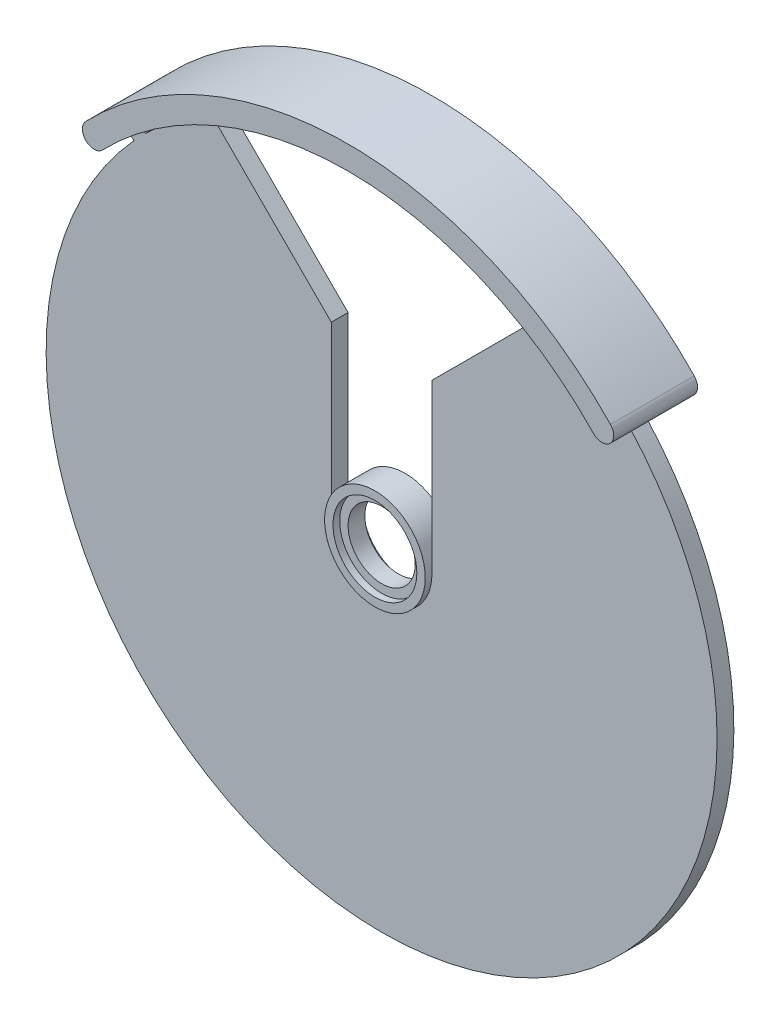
from build123d import *
from build123d.topology import SkipClean

# Parameters (mm, degrees)
SKETCH1_R            = 25.4
SKETCH1_R_2          = 2.54
BOSS_EXTRUDE1_DEPTH  = 1.27
BOSS_EXTRUDE2_START  = -1.27
BOSS_EXTRUDE2_DEPTH  = 1.27
BOSS_EXTRUDE3_START  = -1.27
BOSS_EXTRUDE3_DEPTH  = 1.27
SKETCH4_R            = 0.889
BOSS_EXTRUDE6_DEPTH  = 2.54
CUT_EXTRUDE1_DEPTH   = 2.54
BOSS_EXTRUDE7_START  = -1.27
BOSS_EXTRUDE7_DEPTH  = 1.27
BOSS_EXTRUDE8_START  = 2.54
SKETCH8_R            = 0.889
BOSS_EXTRUDE8_DEPTH  = 2.54
SKETCH9_R            = 0.889
BOSS_EXTRUDE9_DEPTH  = 2.54
CUT_EXTRUDE2_START   = -2.54
CUT_EXTRUDE2_DEPTH   = 2.54
SKETCH15_R           = 3.81
SKETCH15_R_2         = 3.175
BOSS_EXTRUDE12_DEPTH = 0.508
BOSS_EXTRUDE14_REACH = 38.478
SKETCH16_R           = 0.889


with BuildPart() as part:
    # Sketch1 → Boss-Extrude1 (new body)
    with BuildSketch(Plane.XY):
        Circle(SKETCH1_R)
        Circle(SKETCH1_R_2, mode=Mode.SUBTRACT)
    extrude(amount=BOSS_EXTRUDE1_DEPTH)

    # Sketch2 → Boss-Extrude2 (add)
    with BuildSketch(Plane.XY.offset(1.27).offset(BOSS_EXTRUDE2_START)):
        with BuildLine():
            Line((-20.115773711, 19.397353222), (-19.397353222, 20.115773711))
            Line((-19.397353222, 20.115773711), (-17.631043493, 18.284045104))
            ThreePointArc((-17.631043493, 18.284045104), (-17.976862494, 17.944147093), (-18.316130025, 17.597709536))
            Line((-18.316130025, 17.597709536), (-20.115773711, 19.397353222))
        make_face()
    extrude(amount=BOSS_EXTRUDE2_DEPTH)

    # Sketch3 → Boss-Extrude3 (add)
    with BuildSketch(Plane.XY.offset(1.27).offset(BOSS_EXTRUDE3_START)):
        with BuildLine():
            Line((-20.115773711, 19.397353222), (-20.834194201, 18.678932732))
            Line((-20.834194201, 18.678932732), (-19.005784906, 16.850523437))
            ThreePointArc((-19.005784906, 16.850523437), (-18.664696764, 17.227567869), (-18.316130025, 17.597709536))
            Line((-18.316130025, 17.597709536), (-20.115773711, 19.397353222))
        make_face()
    extrude(amount=BOSS_EXTRUDE3_DEPTH)

    # Sketch4 → Boss-Extrude6 (add)
    with BuildSketch(Plane(origin=(0, 0, 0), x_dir=(-1, 0, 0), z_dir=(0, 0, -1))):
        with Locations(Location((19.224441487, 18.489666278, 0), (0, 0, 180))):
            Circle(SKETCH4_R)
    extrude(amount=BOSS_EXTRUDE6_DEPTH)

    # Sketch5 → Cut-Extrude1 (cut)
    with BuildSketch(Plane(origin=(0, 0, 0), x_dir=(-1, 0, 0), z_dir=(0, 0, -1))):
        with BuildLine():
            Line((19.397353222, 20.115773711), (17.631043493, 18.284045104))
            ThreePointArc((17.631043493, 18.284045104), (17.757566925, 18.161189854), (17.883234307, 18.037459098))
            Line((17.883234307, 18.037459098), (18.335441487, 18.489666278))
            ThreePointArc((18.335441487, 18.489666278), (19.224441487, 19.378666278), (20.113441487, 18.489666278))
            ThreePointArc((20.113441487, 18.489666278), (19.853059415, 17.861048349), (19.224441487, 17.600666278))
            Line((19.224441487, 17.600666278), (18.754040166, 17.130264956))
            ThreePointArc((18.754040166, 17.130264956), (18.880430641, 16.990860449), (19.005784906, 16.850523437))
            Line((19.005784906, 16.850523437), (20.834194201, 18.678932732))
            Line((20.834194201, 18.678932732), (19.397353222, 20.115773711))
        make_face()
    extrude(amount=-CUT_EXTRUDE1_DEPTH, mode=Mode.SUBTRACT)

    # Sketch7 → Boss-Extrude7 (add)
    with BuildSketch(Plane.XY.offset(1.27).offset(BOSS_EXTRUDE7_START)):
        with BuildLine():
            Line((18.335441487, 18.489666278), (17.883234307, 18.037459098))
            ThreePointArc((17.883234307, 18.037459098), (18.324252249, 17.589251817), (18.754040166, 17.130264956))
            Line((18.754040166, 17.130264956), (19.224441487, 17.600666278))
            ThreePointArc((19.224441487, 17.600666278), (19.853059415, 19.118284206), (18.335441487, 18.489666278))
        make_face()
    extrude(amount=BOSS_EXTRUDE7_DEPTH)

    # Sketch8 → Boss-Extrude8 (add)
    with SkipClean():  # the faces are left unmerged after this step: merging them gives an invalid solid
        with BuildSketch(Plane(origin=(0, 0, 0), x_dir=(-1, 0, 0), z_dir=(0, 0, -1)).offset(BOSS_EXTRUDE8_START)):
            with Locations((-19.224441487, 18.489666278)):
                Circle(SKETCH8_R)
        extrude(amount=-BOSS_EXTRUDE8_DEPTH)

    # Sketch9 → Boss-Extrude9 (add)
    with SkipClean():  # the faces are left unmerged after this step: merging them gives an invalid solid
        with BuildSketch(Plane.XY.offset(1.27)):
            with Locations((-19.224441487, 18.489666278)):
                Circle(SKETCH9_R)
            with Locations((19.224441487, 18.489666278)):
                Circle(SKETCH9_R)
        extrude(amount=BOSS_EXTRUDE9_DEPTH)

    # Sketch10 → Cut-Extrude2 (cut)
    with SkipClean():  # the faces are left unmerged after this step: merging them gives an invalid solid
        with BuildSketch(Plane.XY.offset(1.27).offset(CUT_EXTRUDE2_START)):
            with BuildLine():
                ThreePointArc((-3.81, 0), (-2.694076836, 2.694076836), (0, 3.81))
                Line((0, 3.81), (0, 25.4))
                ThreePointArc((0, 25.4), (-6.717580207, 24.495593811), (-12.9567808, 21.8467808))
                Line((-12.9567808, 21.8467808), (-3.81, 12.7))
                Line((-3.81, 12.7), (-3.81, 0))
            make_face()
            with BuildLine():
                Line((0, 25.4), (0, 3.81))
                ThreePointArc((0, 3.81), (2.694076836, 2.694076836), (3.81, 0))
                Line((3.81, 0), (3.81, 12.7))
                Line((3.81, 12.7), (12.9567808, 21.8467808))
                ThreePointArc((12.9567808, 21.8467808), (6.717580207, 24.495593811), (0, 25.4))
            make_face()
        extrude(amount=CUT_EXTRUDE2_DEPTH, mode=Mode.SUBTRACT)

    # Sketch15 → Boss-Extrude12 (add)
    with SkipClean():  # the faces are left unmerged after this step: merging them gives an invalid solid
        with BuildSketch(Plane.XY.offset(1.27)):
            Circle(SKETCH15_R)
            Circle(SKETCH15_R_2, mode=Mode.SUBTRACT)
        boss_extrude12 = extrude(amount=BOSS_EXTRUDE12_DEPTH)

    # Mirror5: Boss-Extrude12 across plane
    with SkipClean():  # the faces are left unmerged after this step: merging them gives an invalid solid
        add(boss_extrude12.mirror(Plane.XY.offset(0.635)))

    # Boss-Extrude14: up to this face of the body (flat: up to its plane)
    boss_extrude14_end = Plane(part.part.faces().sort_by_distance((-19.224441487, 18.489666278, -2.54))[0])
    # Sketch16 → Boss-Extrude14 (add, up to the picked face)
    with BuildSketch(Plane.XY.offset(3.81), mode=Mode.PRIVATE) as boss_extrude14_sk1:
        with Locations((-19.224441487, 18.489666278)):
            Circle(SKETCH16_R)
    boss_extrude14_tool1 = split(extrude(boss_extrude14_sk1.sketch, amount=-BOSS_EXTRUDE14_REACH, mode=Mode.PRIVATE), bisect_by=boss_extrude14_end, keep=Keep.BOTH, mode=Mode.PRIVATE)
    # Sketch16 → Boss-Extrude14 (add, up to the picked face)
    with BuildSketch(Plane.XY.offset(3.81), mode=Mode.PRIVATE) as boss_extrude14_sk2:
        with BuildLine():
            ThreePointArc((-18.583697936, 17.873412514), (0, 25.783962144), (18.583697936, 17.873412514))
            ThreePointArc((18.583697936, 17.873412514), (18.608187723, 19.130409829), (19.865185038, 19.105920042))
            ThreePointArc((19.865185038, 19.105920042), (0, 27.561962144), (-19.865185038, 19.105920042))
            ThreePointArc((-19.865185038, 19.105920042), (-18.892251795, 19.314269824), (-18.335441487, 18.489666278))
            ThreePointArc((-18.335441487, 18.489666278), (-18.399837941, 18.157476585), (-18.583697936, 17.873412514))
        make_face()
    boss_extrude14_tool2 = split(extrude(boss_extrude14_sk2.sketch, amount=-BOSS_EXTRUDE14_REACH, mode=Mode.PRIVATE), bisect_by=boss_extrude14_end, keep=Keep.BOTH, mode=Mode.PRIVATE)
    # Sketch16 → Boss-Extrude14 (add, up to the picked face)
    with BuildSketch(Plane.XY.offset(3.81), mode=Mode.PRIVATE) as boss_extrude14_sk3:
        with Locations((19.224441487, 18.489666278)):
            Circle(SKETCH16_R)
    boss_extrude14_tool3 = split(extrude(boss_extrude14_sk3.sketch, amount=-BOSS_EXTRUDE14_REACH, mode=Mode.PRIVATE), bisect_by=boss_extrude14_end, keep=Keep.BOTH, mode=Mode.PRIVATE)
    # Sketch16 → Boss-Extrude14 (add, up to the picked face)
    with BuildSketch(Plane.XY.offset(3.81), mode=Mode.PRIVATE) as boss_extrude14_sk4:
        with Locations((-19.224441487, 18.489666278)):
            Circle(SKETCH16_R)
    boss_extrude14_tool4 = split(extrude(boss_extrude14_sk4.sketch, amount=-BOSS_EXTRUDE14_REACH, mode=Mode.PRIVATE), bisect_by=boss_extrude14_end, keep=Keep.BOTH, mode=Mode.PRIVATE)
    add(boss_extrude14_tool1.solids().sort_by(Axis((-19.224441, 18.489666, 3.81), (0, 0, -1)))[0])
    add(boss_extrude14_tool2.solids().sort_by(Axis((-18.739442, 19.693593, 3.81), (0, 0, -1)))[0])
    add(boss_extrude14_tool3.solids().sort_by(Axis((19.224441, 18.489666, 3.81), (0, 0, -1)))[0])
    add(boss_extrude14_tool4.solids().sort_by(Axis((-19.224441, 18.489666, 3.81), (0, 0, -1)))[0])


solid = part.part
